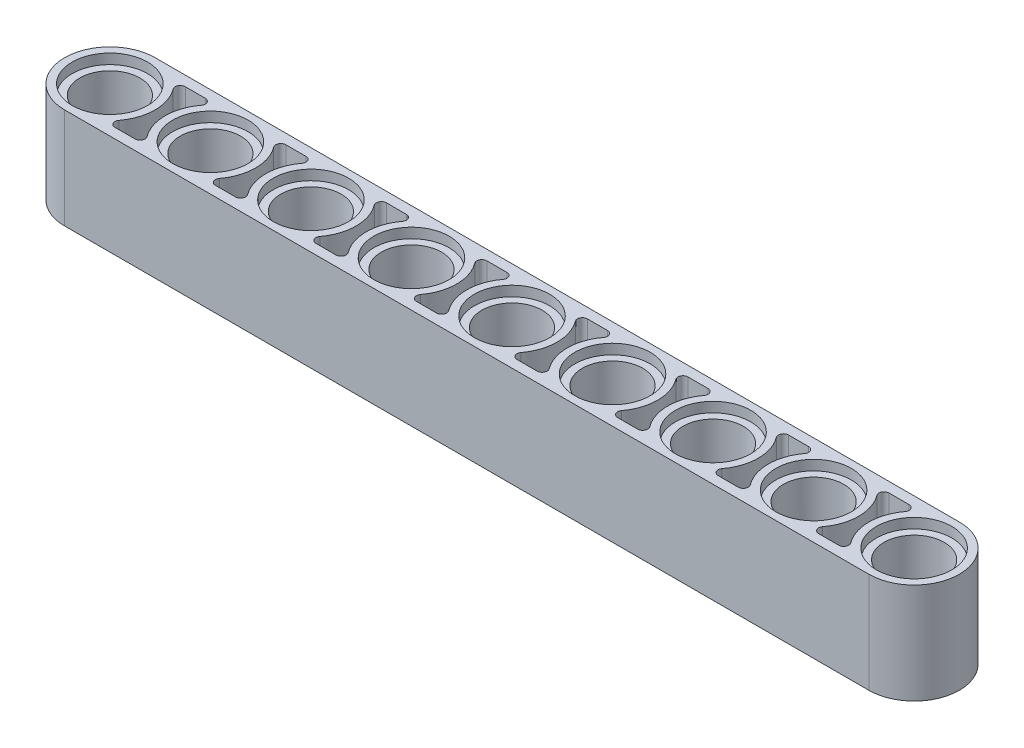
from build123d import *

# Parameters (mm, degrees)
SKETCH1_R           = 2.4
BOSS_EXTRUDE1_DEPTH = 8
SKETCH2_R           = 3
CUT_EXTRUDE1_DEPTH  = 0.8
CUT_EXTRUDE2_START  = -3.2
CUT_EXTRUDE2_DEPTH  = 3.2
CUT_EXTRUDE3_START  = -8
CUT_EXTRUDE3_DEPTH  = 8
CUT_EXTRUDE4_START  = -8
CUT_EXTRUDE4_DEPTH  = 8
CUT_EXTRUDE5_START  = -8
CUT_EXTRUDE5_DEPTH  = 8


with BuildPart() as part:
    # Sketch1 → Boss-Extrude1 (new body)
    with BuildSketch(Plane(origin=(0, 0, 0), x_dir=(1, 0, 0), z_dir=(0, 1, 0))):
        with BuildLine():
            Line((0, -3.6), (112, -3.6))
            ThreePointArc((112, -3.6), (115.6, 0), (112, 3.6))
            Line((112, 3.6), (0, 3.6))
            ThreePointArc((0, 3.6), (-3.6, 0), (0, -3.6))
        make_face()
        with Locations(Location((0, 0, 0), (0, 0, 270))):
            Circle(SKETCH1_R, mode=Mode.SUBTRACT)
        with Locations(Location((8, 0, 0), (0, 0, 270))):
            Circle(SKETCH1_R, mode=Mode.SUBTRACT)
        with Locations(Location((16, 0, 0), (0, 0, 270))):
            Circle(SKETCH1_R, mode=Mode.SUBTRACT)
        with Locations(Location((24, 0, 0), (0, 0, 270))):
            Circle(SKETCH1_R, mode=Mode.SUBTRACT)
        with Locations(Location((32, 0, 0), (0, 0, 270))):
            Circle(SKETCH1_R, mode=Mode.SUBTRACT)
        with Locations(Location((40, 0, 0), (0, 0, 270))):
            Circle(SKETCH1_R, mode=Mode.SUBTRACT)
        with Locations(Location((48, 0, 0), (0, 0, 270))):
            Circle(SKETCH1_R, mode=Mode.SUBTRACT)
        with Locations(Location((56, 0, 0), (0, 0, 270))):
            Circle(SKETCH1_R, mode=Mode.SUBTRACT)
        with Locations(Location((64, 0, 0), (0, 0, 270))):
            Circle(SKETCH1_R, mode=Mode.SUBTRACT)
        with Locations(Location((72, 0, 0), (0, 0, 270))):
            Circle(SKETCH1_R, mode=Mode.SUBTRACT)
        with Locations(Location((80, 0, 0), (0, 0, 270))):
            Circle(SKETCH1_R, mode=Mode.SUBTRACT)
        with Locations(Location((88, 0, 0), (0, 0, 270))):
            Circle(SKETCH1_R, mode=Mode.SUBTRACT)
        with Locations(Location((96, 0, 0), (0, 0, 270))):
            Circle(SKETCH1_R, mode=Mode.SUBTRACT)
        with Locations(Location((104, 0, 0), (0, 0, 270))):
            Circle(SKETCH1_R, mode=Mode.SUBTRACT)
        with Locations(Location((112, 0, 0), (0, 0, 270))):
            Circle(SKETCH1_R, mode=Mode.SUBTRACT)
    extrude(amount=BOSS_EXTRUDE1_DEPTH)

    # Sketch2 → Cut-Extrude1 (cut)
    with BuildSketch(Plane(origin=(0, 8, 0), x_dir=(1, 0, 0), z_dir=(0, 1, 0))):
        with Locations(Location((0, 0, 0), (0, 0, 270))):
            Circle(SKETCH2_R)
        with Locations(Location((8, 0, 0), (0, 0, 270))):
            Circle(SKETCH2_R)
        with Locations(Location((16, 0, 0), (0, 0, 270))):
            Circle(SKETCH2_R)
        with Locations(Location((24, 0, 0), (0, 0, 270))):
            Circle(SKETCH2_R)
        with Locations(Location((32, 0, 0), (0, 0, 270))):
            Circle(SKETCH2_R)
        with Locations(Location((40, 0, 0), (0, 0, 270))):
            Circle(SKETCH2_R)
        with Locations(Location((48, 0, 0), (0, 0, 270))):
            Circle(SKETCH2_R)
        with Locations(Location((56, 0, 0), (0, 0, 270))):
            Circle(SKETCH2_R)
        with Locations(Location((64, 0, 0), (0, 0, 270))):
            Circle(SKETCH2_R)
        with Locations(Location((72, 0, 0), (0, 0, 270))):
            Circle(SKETCH2_R)
        with Locations(Location((80, 0, 0), (0, 0, 270))):
            Circle(SKETCH2_R)
        with Locations(Location((88, 0, 0), (0, 0, 270))):
            Circle(SKETCH2_R)
        with Locations(Location((96, 0, 0), (0, 0, 270))):
            Circle(SKETCH2_R)
        with Locations(Location((104, 0, 0), (0, 0, 270))):
            Circle(SKETCH2_R)
        with Locations(Location((112, 0, 0), (0, 0, 270))):
            Circle(SKETCH2_R)
    cut_extrude1 = extrude(amount=-CUT_EXTRUDE1_DEPTH, mode=Mode.SUBTRACT)

    # Sketch3 → Cut-Extrude2 (cut)
    with BuildSketch(Plane(origin=(0, 8, 0), x_dir=(1, 0, 0), z_dir=(0, 1, 0)).offset(CUT_EXTRUDE2_START)):
        with BuildLine():
            Line((3.2, 2.8), (4.8, 2.8))
            ThreePointArc((4.8, 2.8), (5.157770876, 2.578885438), (5.12, 2.16))
            ThreePointArc((5.12, 2.16), (4.4, 0), (5.12, -2.16))
            ThreePointArc((5.12, -2.16), (5.157770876, -2.578885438), (4.8, -2.8))
            Line((4.8, -2.8), (3.2, -2.8))
            ThreePointArc((3.2, -2.8), (2.842229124, -2.578885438), (2.88, -2.16))
            ThreePointArc((2.88, -2.16), (3.6, 0), (2.88, 2.16))
            ThreePointArc((2.88, 2.16), (2.842229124, 2.578885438), (3.2, 2.8))
        make_face()
        with BuildLine():
            Line((11.2, 2.8), (12.8, 2.8))
            ThreePointArc((12.8, 2.8), (13.157770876, 2.578885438), (13.12, 2.16))
            ThreePointArc((13.12, 2.16), (12.4, 0), (13.12, -2.16))
            ThreePointArc((13.12, -2.16), (13.157770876, -2.578885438), (12.8, -2.8))
            Line((12.8, -2.8), (11.2, -2.8))
            ThreePointArc((11.2, -2.8), (10.842229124, -2.578885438), (10.88, -2.16))
            ThreePointArc((10.88, -2.16), (11.6, 0), (10.88, 2.16))
            ThreePointArc((10.88, 2.16), (10.842229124, 2.578885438), (11.2, 2.8))
        make_face()
        with BuildLine():
            Line((19.2, 2.8), (20.8, 2.8))
            ThreePointArc((20.8, 2.8), (21.157770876, 2.578885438), (21.12, 2.16))
            ThreePointArc((21.12, 2.16), (20.4, 0), (21.12, -2.16))
            ThreePointArc((21.12, -2.16), (21.157770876, -2.578885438), (20.8, -2.8))
            Line((20.8, -2.8), (19.2, -2.8))
            ThreePointArc((19.2, -2.8), (18.842229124, -2.578885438), (18.88, -2.16))
            ThreePointArc((18.88, -2.16), (19.6, 0), (18.88, 2.16))
            ThreePointArc((18.88, 2.16), (18.842229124, 2.578885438), (19.2, 2.8))
        make_face()
        with BuildLine():
            Line((27.2, 2.8), (28.8, 2.8))
            ThreePointArc((28.8, 2.8), (29.157770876, 2.578885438), (29.12, 2.16))
            ThreePointArc((29.12, 2.16), (28.4, 0), (29.12, -2.16))
            ThreePointArc((29.12, -2.16), (29.157770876, -2.578885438), (28.8, -2.8))
            Line((28.8, -2.8), (27.2, -2.8))
            ThreePointArc((27.2, -2.8), (26.842229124, -2.578885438), (26.88, -2.16))
            ThreePointArc((26.88, -2.16), (27.6, 0), (26.88, 2.16))
            ThreePointArc((26.88, 2.16), (26.842229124, 2.578885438), (27.2, 2.8))
        make_face()
        with BuildLine():
            Line((35.2, 2.8), (36.8, 2.8))
            ThreePointArc((36.8, 2.8), (37.157770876, 2.578885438), (37.12, 2.16))
            ThreePointArc((37.12, 2.16), (36.4, 0), (37.12, -2.16))
            ThreePointArc((37.12, -2.16), (37.157770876, -2.578885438), (36.8, -2.8))
            Line((36.8, -2.8), (35.2, -2.8))
            ThreePointArc((35.2, -2.8), (34.842229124, -2.578885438), (34.88, -2.16))
            ThreePointArc((34.88, -2.16), (35.6, 0), (34.88, 2.16))
            ThreePointArc((34.88, 2.16), (34.842229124, 2.578885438), (35.2, 2.8))
        make_face()
        with BuildLine():
            Line((43.2, 2.8), (44.8, 2.8))
            ThreePointArc((44.8, 2.8), (45.157770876, 2.578885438), (45.12, 2.16))
            ThreePointArc((45.12, 2.16), (44.4, 0), (45.12, -2.16))
            ThreePointArc((45.12, -2.16), (45.157770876, -2.578885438), (44.8, -2.8))
            Line((44.8, -2.8), (43.2, -2.8))
            ThreePointArc((43.2, -2.8), (42.842229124, -2.578885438), (42.88, -2.16))
            ThreePointArc((42.88, -2.16), (43.6, 0), (42.88, 2.16))
            ThreePointArc((42.88, 2.16), (42.842229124, 2.578885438), (43.2, 2.8))
        make_face()
        with BuildLine():
            Line((51.2, 2.8), (52.8, 2.8))
            ThreePointArc((52.8, 2.8), (53.157770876, 2.578885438), (53.12, 2.16))
            ThreePointArc((53.12, 2.16), (52.4, 0), (53.12, -2.16))
            ThreePointArc((53.12, -2.16), (53.157770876, -2.578885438), (52.8, -2.8))
            Line((52.8, -2.8), (51.2, -2.8))
            ThreePointArc((51.2, -2.8), (50.842229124, -2.578885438), (50.88, -2.16))
            ThreePointArc((50.88, -2.16), (51.6, 0), (50.88, 2.16))
            ThreePointArc((50.88, 2.16), (50.842229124, 2.578885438), (51.2, 2.8))
        make_face()
        with BuildLine():
            Line((59.2, 2.8), (60.8, 2.8))
            ThreePointArc((60.8, 2.8), (61.157770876, 2.578885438), (61.12, 2.16))
            ThreePointArc((61.12, 2.16), (60.4, 0), (61.12, -2.16))
            ThreePointArc((61.12, -2.16), (61.157770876, -2.578885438), (60.8, -2.8))
            Line((60.8, -2.8), (59.2, -2.8))
            ThreePointArc((59.2, -2.8), (58.842229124, -2.578885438), (58.88, -2.16))
            ThreePointArc((58.88, -2.16), (59.6, 0), (58.88, 2.16))
            ThreePointArc((58.88, 2.16), (58.842229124, 2.578885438), (59.2, 2.8))
        make_face()
        with BuildLine():
            Line((67.2, 2.8), (68.8, 2.8))
            ThreePointArc((68.8, 2.8), (69.157770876, 2.578885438), (69.12, 2.16))
            ThreePointArc((69.12, 2.16), (68.4, 0), (69.12, -2.16))
            ThreePointArc((69.12, -2.16), (69.157770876, -2.578885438), (68.8, -2.8))
            Line((68.8, -2.8), (67.2, -2.8))
            ThreePointArc((67.2, -2.8), (66.842229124, -2.578885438), (66.88, -2.16))
            ThreePointArc((66.88, -2.16), (67.6, 0), (66.88, 2.16))
            ThreePointArc((66.88, 2.16), (66.842229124, 2.578885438), (67.2, 2.8))
        make_face()
        with BuildLine():
            Line((75.2, 2.8), (76.8, 2.8))
            ThreePointArc((76.8, 2.8), (77.157770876, 2.578885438), (77.12, 2.16))
            ThreePointArc((77.12, 2.16), (76.4, 0), (77.12, -2.16))
            ThreePointArc((77.12, -2.16), (77.157770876, -2.578885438), (76.8, -2.8))
            Line((76.8, -2.8), (75.2, -2.8))
            ThreePointArc((75.2, -2.8), (74.842229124, -2.578885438), (74.88, -2.16))
            ThreePointArc((74.88, -2.16), (75.6, 0), (74.88, 2.16))
            ThreePointArc((74.88, 2.16), (74.842229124, 2.578885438), (75.2, 2.8))
        make_face()
        with BuildLine():
            Line((83.2, 2.8), (84.8, 2.8))
            ThreePointArc((84.8, 2.8), (85.157770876, 2.578885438), (85.12, 2.16))
            ThreePointArc((85.12, 2.16), (84.4, 0), (85.12, -2.16))
            ThreePointArc((85.12, -2.16), (85.157770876, -2.578885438), (84.8, -2.8))
            Line((84.8, -2.8), (83.2, -2.8))
            ThreePointArc((83.2, -2.8), (82.842229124, -2.578885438), (82.88, -2.16))
            ThreePointArc((82.88, -2.16), (83.6, 0), (82.88, 2.16))
            ThreePointArc((82.88, 2.16), (82.842229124, 2.578885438), (83.2, 2.8))
        make_face()
        with BuildLine():
            Line((91.2, 2.8), (92.8, 2.8))
            ThreePointArc((92.8, 2.8), (93.157770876, 2.578885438), (93.12, 2.16))
            ThreePointArc((93.12, 2.16), (92.4, 0), (93.12, -2.16))
            ThreePointArc((93.12, -2.16), (93.157770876, -2.578885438), (92.8, -2.8))
            Line((92.8, -2.8), (91.2, -2.8))
            ThreePointArc((91.2, -2.8), (90.842229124, -2.578885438), (90.88, -2.16))
            ThreePointArc((90.88, -2.16), (91.6, 0), (90.88, 2.16))
            ThreePointArc((90.88, 2.16), (90.842229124, 2.578885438), (91.2, 2.8))
        make_face()
        with BuildLine():
            Line((99.2, 2.8), (100.8, 2.8))
            ThreePointArc((100.8, 2.8), (101.157770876, 2.578885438), (101.12, 2.16))
            ThreePointArc((101.12, 2.16), (100.4, 0), (101.12, -2.16))
            ThreePointArc((101.12, -2.16), (101.157770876, -2.578885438), (100.8, -2.8))
            Line((100.8, -2.8), (99.2, -2.8))
            ThreePointArc((99.2, -2.8), (98.842229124, -2.578885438), (98.88, -2.16))
            ThreePointArc((98.88, -2.16), (99.6, 0), (98.88, 2.16))
            ThreePointArc((98.88, 2.16), (98.842229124, 2.578885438), (99.2, 2.8))
        make_face()
        with BuildLine():
            Line((107.2, 2.8), (108.8, 2.8))
            ThreePointArc((108.8, 2.8), (109.157770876, 2.578885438), (109.12, 2.16))
            ThreePointArc((109.12, 2.16), (108.4, 0), (109.12, -2.16))
            ThreePointArc((109.12, -2.16), (109.157770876, -2.578885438), (108.8, -2.8))
            Line((108.8, -2.8), (107.2, -2.8))
            ThreePointArc((107.2, -2.8), (106.842229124, -2.578885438), (106.88, -2.16))
            ThreePointArc((106.88, -2.16), (107.6, 0), (106.88, 2.16))
            ThreePointArc((106.88, 2.16), (106.842229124, 2.578885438), (107.2, 2.8))
        make_face()
    cut_extrude2 = extrude(amount=CUT_EXTRUDE2_DEPTH, mode=Mode.SUBTRACT)

    # Mirror1: Cut-Extrude1, Cut-Extrude2 across plane
    add(cut_extrude1.mirror(Plane.ZX.offset(4)), mode=Mode.SUBTRACT)
    add(cut_extrude2.mirror(Plane.ZX.offset(4)), mode=Mode.SUBTRACT)

    # Sketch4 → Cut-Extrude3 (cut)
    with BuildSketch(Plane(origin=(0, 8, 0), x_dir=(1, 0, 0), z_dir=(0, 1, 0)).offset(CUT_EXTRUDE3_START)):
        with BuildLine():
            Line((96, 3.6), (112, 3.6))
            ThreePointArc((112, 3.6), (115.6, 0), (112, -3.6))
            Line((112, -3.6), (96, -3.6))
            ThreePointArc((96, -3.6), (99.6, 0), (96, 3.6))
        make_face()
    extrude(amount=CUT_EXTRUDE3_DEPTH, mode=Mode.SUBTRACT)

    # Sketch5 → Cut-Extrude4 (cut)
    with BuildSketch(Plane(origin=(0, 8, 0), x_dir=(1, 0, 0), z_dir=(0, 1, 0)).offset(CUT_EXTRUDE4_START)):
        with BuildLine():
            Line((80, 3.6), (96, 3.6))
            ThreePointArc((96, 3.6), (99.6, 0), (96, -3.6))
            Line((96, -3.6), (80, -3.6))
            ThreePointArc((80, -3.6), (83.6, 0), (80, 3.6))
        make_face()
    extrude(amount=CUT_EXTRUDE4_DEPTH, mode=Mode.SUBTRACT)

    # Sketch6 → Cut-Extrude5 (cut)
    with BuildSketch(Plane(origin=(0, 8, 0), x_dir=(1, 0, 0), z_dir=(0, 1, 0)).offset(CUT_EXTRUDE5_START)):
        with BuildLine():
            Line((64, 3.6), (80, 3.6))
            ThreePointArc((80, 3.6), (83.6, 0), (80, -3.6))
            Line((80, -3.6), (64, -3.6))
            ThreePointArc((64, -3.6), (67.6, 0), (64, 3.6))
        make_face()
    extrude(amount=CUT_EXTRUDE5_DEPTH, mode=Mode.SUBTRACT)


solid = part.part
